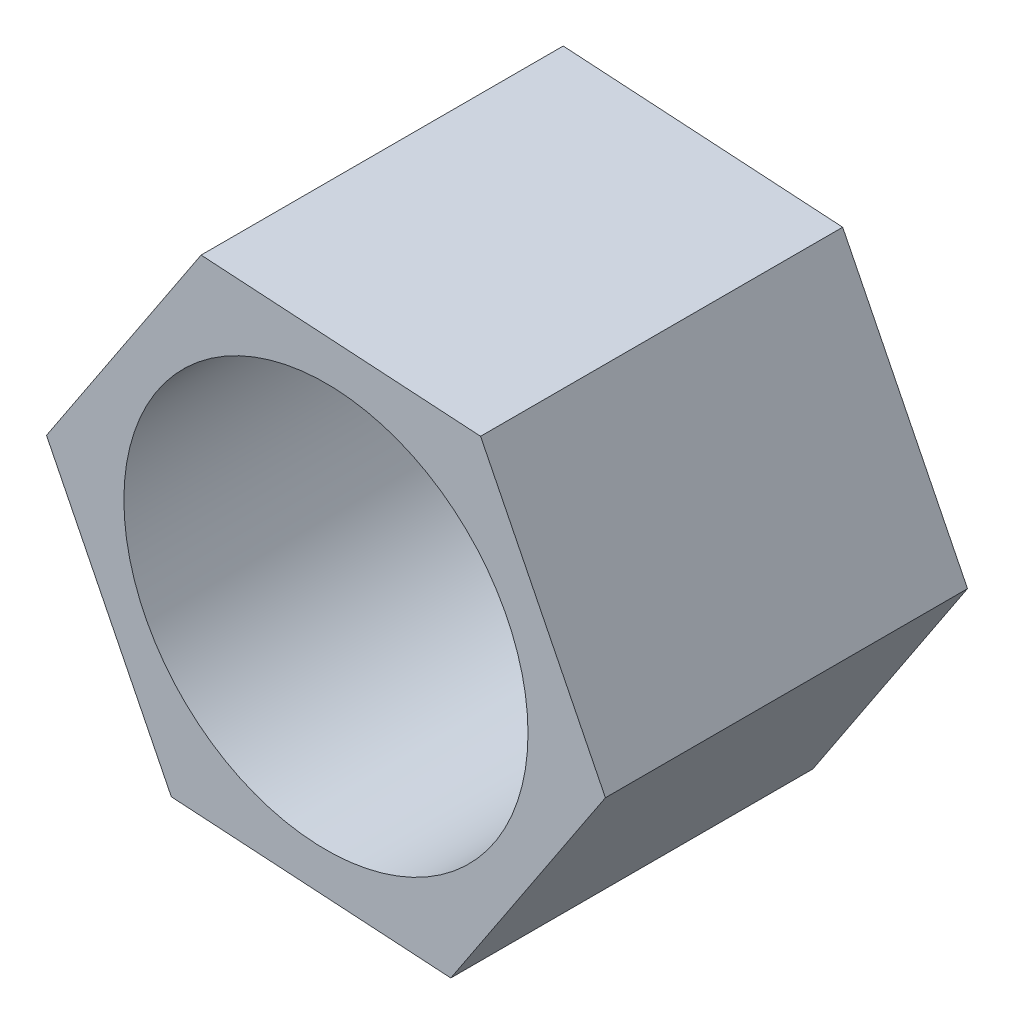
from build123d import *

# Parameters (mm, degrees)
SALIENTE_EXTRUIR1_DEPTH = 8.96
CROQUIS2_R              = 5
CORTAR_EXTRUIR1_DEPTH   = 8.96


with BuildPart() as part:
    # Croquis1 → Saliente-Extruir1 (new body)
    with BuildSketch(Plane.XY):
        Polygon((3.826127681, 5.775876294), (-3.088991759, 6.201461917), (-6.915119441, 0.425585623), (-3.826127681, -5.775876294), (3.088991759, -6.201461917), (6.915119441, -0.425585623), align=None)
    extrude(amount=SALIENTE_EXTRUIR1_DEPTH)

    # Croquis2 → Cortar-Extruir1 (cut)
    with BuildSketch(Plane.XY.offset(8.96)):
        Circle(CROQUIS2_R)
    extrude(amount=-CORTAR_EXTRUIR1_DEPTH, mode=Mode.SUBTRACT)


solid = part.part
